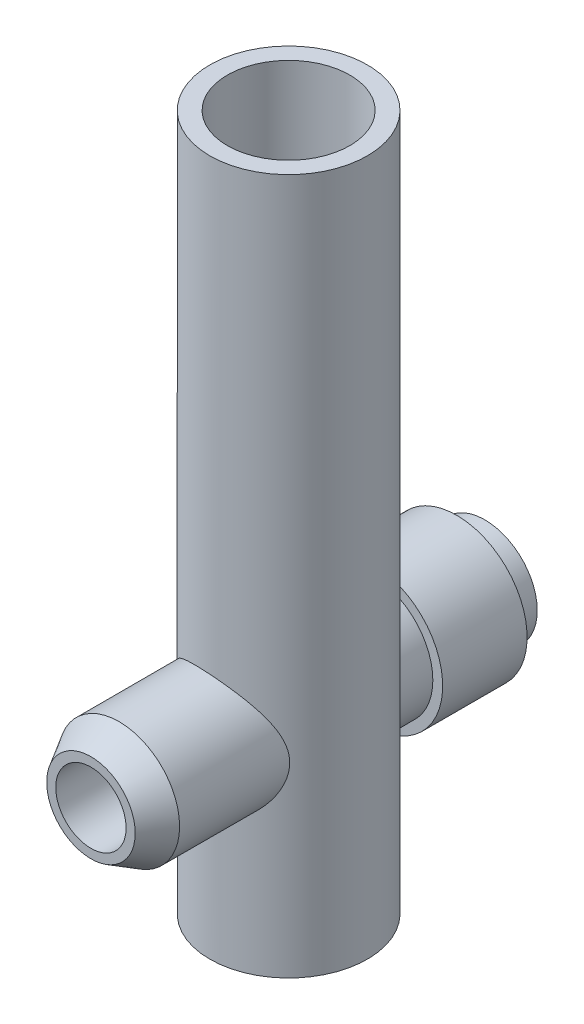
ISO-10303-21;
HEADER;
FILE_DESCRIPTION(('STEP AP214'),'2;1');
FILE_NAME('part.step','',(''),(''),'','','');
FILE_SCHEMA(('AUTOMOTIVE_DESIGN { 1 0 10303 214 1 1 1 1 }'));
ENDSEC;
DATA;
#1=APPLICATION_CONTEXT('core data for automotive mechanical design processes');
#2=APPLICATION_PROTOCOL_DEFINITION('international standard','automotive_design',2000,#1);
#3=PRODUCT_CONTEXT('',#1,'mechanical');
#4=PRODUCT('Part','Part','',(#3));
#5=PRODUCT_RELATED_PRODUCT_CATEGORY('part','',(#4));
#6=PRODUCT_DEFINITION_FORMATION('','',#4);
#7=PRODUCT_DEFINITION_CONTEXT('part definition',#1,'design');
#8=PRODUCT_DEFINITION('design','',#6,#7);
#9=PRODUCT_DEFINITION_SHAPE('','',#8);
#10=(LENGTH_UNIT() NAMED_UNIT(*) SI_UNIT(.MILLI.,.METRE.));
#11=(NAMED_UNIT(*) PLANE_ANGLE_UNIT() SI_UNIT($,.RADIAN.));
#12=(NAMED_UNIT(*) SI_UNIT($,.STERADIAN.) SOLID_ANGLE_UNIT());
#13=UNCERTAINTY_MEASURE_WITH_UNIT(LENGTH_MEASURE(1.E-05),#10,'distance_accuracy_value','');
#14=(GEOMETRIC_REPRESENTATION_CONTEXT(3) GLOBAL_UNCERTAINTY_ASSIGNED_CONTEXT((#13)) GLOBAL_UNIT_ASSIGNED_CONTEXT((#10,
#11,#12)) REPRESENTATION_CONTEXT('',''));
#15=CARTESIAN_POINT('',(0.,0.,0.));
#16=DIRECTION('',(0.,0.,1.));
#17=DIRECTION('',(1.,0.,0.));
#18=AXIS2_PLACEMENT_3D('',#15,#16,#17);
#19=CARTESIAN_POINT('',(0.,0.,0.));
#20=DIRECTION('',(0.,0.,1.));
#21=DIRECTION('',(1.,0.,0.));
#22=AXIS2_PLACEMENT_3D('',#19,#20,#21);
#23=CYLINDRICAL_SURFACE('',#22,3.175);
#24=CARTESIAN_POINT('',(3.175,0.,11.5573082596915));
#25=CARTESIAN_POINT('',(3.17499890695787,0.0853927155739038,11.5573072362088));
#26=CARTESIAN_POINT('',(3.1715482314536,0.170810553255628,11.5558295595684));
#27=CARTESIAN_POINT('',(3.15779168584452,0.341006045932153,11.5499801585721));
#28=CARTESIAN_POINT('',(3.14748190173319,0.425783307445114,11.5456067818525));
#29=CARTESIAN_POINT('',(3.10633956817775,0.678505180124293,11.5283272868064));
#30=CARTESIAN_POINT('',(3.06529432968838,0.84463178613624,11.5112623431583));
#31=CARTESIAN_POINT('',(2.95784444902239,1.1664124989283,11.4684966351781));
#32=CARTESIAN_POINT('',(2.89153438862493,1.32210314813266,11.4428281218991));
#33=CARTESIAN_POINT('',(2.73565251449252,1.62022034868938,11.3860904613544));
#34=CARTESIAN_POINT('',(2.64608444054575,1.76264902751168,11.355022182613));
#35=CARTESIAN_POINT('',(2.44074358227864,2.03823963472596,11.2894034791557));
#36=CARTESIAN_POINT('',(2.32386455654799,2.17055463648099,11.2547562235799));
#37=CARTESIAN_POINT('',(2.06946914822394,2.41432474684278,11.1875861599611));
#38=CARTESIAN_POINT('',(1.93194701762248,2.52577402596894,11.1550639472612));
#39=CARTESIAN_POINT('',(1.63523892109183,2.72757803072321,11.0952910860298));
#40=CARTESIAN_POINT('',(1.47555470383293,2.81725574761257,11.0682132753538));
#41=CARTESIAN_POINT('',(1.14196767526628,2.96816356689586,11.0243325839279));
#42=CARTESIAN_POINT('',(0.968072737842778,3.0294092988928,11.0075240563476));
#43=CARTESIAN_POINT('',(0.62258583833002,3.11814578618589,10.9876301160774));
#44=CARTESIAN_POINT('',(0.451514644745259,3.14748724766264,10.9837614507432));
#45=CARTESIAN_POINT('',(0.107083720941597,3.17789557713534,10.9886929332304));
#46=CARTESIAN_POINT('',(-0.0662752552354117,3.17897153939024,10.9974890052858));
#47=CARTESIAN_POINT('',(-0.400650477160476,3.15384459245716,11.0266960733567));
#48=CARTESIAN_POINT('',(-0.561834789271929,3.12908052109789,11.0464685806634));
#49=CARTESIAN_POINT('',(-0.877093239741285,3.05573848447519,11.095841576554));
#50=CARTESIAN_POINT('',(-1.03116635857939,3.00715711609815,11.1254434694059));
#51=CARTESIAN_POINT('',(-1.33395756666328,2.88595082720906,11.1935592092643));
#52=CARTESIAN_POINT('',(-1.48229782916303,2.81254177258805,11.2323494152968));
#53=CARTESIAN_POINT('',(-1.76475640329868,2.64448478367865,11.3153189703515));
#54=CARTESIAN_POINT('',(-1.8988685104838,2.54982763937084,11.3595006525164));
#55=CARTESIAN_POINT('',(-2.16194296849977,2.33202933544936,11.4540640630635));
#56=CARTESIAN_POINT('',(-2.28934636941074,2.20708777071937,11.5046453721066));
#57=CARTESIAN_POINT('',(-2.52191021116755,1.93710215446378,11.603682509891));
#58=CARTESIAN_POINT('',(-2.62705727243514,1.79204609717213,11.6521370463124));
#59=CARTESIAN_POINT('',(-2.81556373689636,1.47910288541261,11.7434540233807));
#60=CARTESIAN_POINT('',(-2.89801608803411,1.31058757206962,11.786056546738));
#61=CARTESIAN_POINT('',(-3.03246822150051,0.959182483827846,11.8577351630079));
#62=CARTESIAN_POINT('',(-3.08450680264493,0.776311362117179,11.8868284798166));
#63=CARTESIAN_POINT('',(-3.1516342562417,0.420937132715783,11.9247870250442));
#64=CARTESIAN_POINT('',(-3.16989207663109,0.249220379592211,11.9353810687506));
#65=CARTESIAN_POINT('',(-3.17823715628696,-0.0950929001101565,11.9401936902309));
#66=CARTESIAN_POINT('',(-3.16833801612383,-0.26768896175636,11.9344201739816));
#67=CARTESIAN_POINT('',(-3.12329903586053,-0.59141605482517,11.9087216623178));
#68=CARTESIAN_POINT('',(-3.0906632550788,-0.743021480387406,11.8902026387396));
#69=CARTESIAN_POINT('',(-3.00434564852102,-1.03837304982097,11.8427106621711));
#70=CARTESIAN_POINT('',(-2.95065773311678,-1.18211690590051,11.813734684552));
#71=CARTESIAN_POINT('',(-2.82025781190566,-1.46724493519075,11.7462660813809));
#72=CARTESIAN_POINT('',(-2.74236055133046,-1.60797348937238,11.707307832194));
#73=CARTESIAN_POINT('',(-2.56708601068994,-1.87516837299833,11.6245777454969));
#74=CARTESIAN_POINT('',(-2.46969842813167,-2.00162710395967,11.5808033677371));
#75=CARTESIAN_POINT('',(-2.24420482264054,-2.25301748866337,11.486483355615));
#76=CARTESIAN_POINT('',(-2.11378878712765,-2.37582354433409,11.4357701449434));
#77=CARTESIAN_POINT('',(-1.8334290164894,-2.59830669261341,11.3374027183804));
#78=CARTESIAN_POINT('',(-1.68347896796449,-2.69797627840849,11.2897494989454));
#79=CARTESIAN_POINT('',(-1.36269957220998,-2.87367700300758,11.2005078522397));
#80=CARTESIAN_POINT('',(-1.19140269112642,-2.94896701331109,11.1591269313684));
#81=CARTESIAN_POINT('',(-0.836071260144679,-3.06866121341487,11.0880771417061));
#82=CARTESIAN_POINT('',(-0.652046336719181,-3.11308847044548,11.058399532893));
#83=CARTESIAN_POINT('',(-0.2926915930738,-3.16625937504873,11.0153591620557));
#84=CARTESIAN_POINT('',(-0.117886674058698,-3.17763103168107,11.0008578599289));
#85=CARTESIAN_POINT('',(0.231775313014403,-3.17134757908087,10.984915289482));
#86=CARTESIAN_POINT('',(0.406632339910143,-3.15370287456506,10.9834693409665));
#87=CARTESIAN_POINT('',(0.739699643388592,-3.09197902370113,10.9927199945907));
#88=CARTESIAN_POINT('',(0.898261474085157,-3.04965191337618,11.00265041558));
#89=CARTESIAN_POINT('',(1.20621470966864,-2.94148153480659,11.0318434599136));
#90=CARTESIAN_POINT('',(1.35560502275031,-2.87563547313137,11.0511071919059));
#91=CARTESIAN_POINT('',(1.64588322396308,-2.72021936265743,11.0972958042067));
#92=CARTESIAN_POINT('',(1.78639693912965,-2.63001441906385,11.1244274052));
#93=CARTESIAN_POINT('',(2.05105553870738,-2.42927984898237,11.1830325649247));
#94=CARTESIAN_POINT('',(2.17519481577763,-2.31874329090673,11.2145076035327));
#95=CARTESIAN_POINT('',(2.41298687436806,-2.07115825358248,11.280762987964));
#96=CARTESIAN_POINT('',(2.52522172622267,-1.93276677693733,11.315617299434));
#97=CARTESIAN_POINT('',(2.72539465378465,-1.63844136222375,11.3821793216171));
#98=CARTESIAN_POINT('',(2.81331677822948,-1.48249600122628,11.4138849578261));
#99=CARTESIAN_POINT('',(2.92544249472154,-1.23721378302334,11.456116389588));
#100=CARTESIAN_POINT('',(2.95972097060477,-1.15282324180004,11.4693914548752));
#101=CARTESIAN_POINT('',(3.02098160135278,-0.981116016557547,11.4935520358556));
#102=CARTESIAN_POINT('',(3.04796709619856,-0.893800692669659,11.5044386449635));
#103=CARTESIAN_POINT('',(3.09430502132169,-0.717097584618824,11.523373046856));
#104=CARTESIAN_POINT('',(3.11367552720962,-0.627715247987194,11.5314275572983));
#105=CARTESIAN_POINT('',(3.14464356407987,-0.447432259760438,11.5444012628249));
#106=CARTESIAN_POINT('',(3.1562464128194,-0.356532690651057,11.549322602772));
#107=CARTESIAN_POINT('',(3.16759632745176,-0.221176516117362,11.5541493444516));
#108=CARTESIAN_POINT('',(3.17037154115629,-0.176997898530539,11.555332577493));
#109=CARTESIAN_POINT('',(3.17407367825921,-0.0885484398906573,11.5569123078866));
#110=CARTESIAN_POINT('',(3.17500056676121,-0.0442775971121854,11.5573087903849));
#111=CARTESIAN_POINT('',(3.175,0.,11.5573082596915));
#112=B_SPLINE_CURVE_WITH_KNOTS('',3,(#24,#25,#26,#27,#28,#29,#30,#31,#32,#33,#34,#35,#36,#37,
#38,#39,#40,#41,#42,#43,#44,#45,#46,#47,#48,#49,#50,#51,#52,#53,#54,#55,#56,#57,#58,#59,#60,#61,
#62,#63,#64,#65,#66,#67,#68,#69,#70,#71,#72,#73,#74,#75,#76,#77,#78,#79,#80,#81,#82,#83,#84,#85,
#86,#87,#88,#89,#90,#91,#92,#93,#94,#95,#96,#97,#98,#99,#100,#101,#102,#103,#104,#105,#106,#107,
#108,#109,#110,#111),.UNSPECIFIED.,.T.,.F.,(4,2,2,2,2,2,2,2,2,2,2,2,2,2,2,2,2,2,2,2,2,2,2,2,2,2,
2,2,2,2,2,2,2,2,2,2,2,2,2,2,2,2,2,4),(0.,0.256130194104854,0.512406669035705,1.02557549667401,
1.53684179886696,2.04802594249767,2.58536343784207,3.12285083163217,3.67536791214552,
4.22758090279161,4.74569747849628,5.26364735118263,5.75422062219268,6.24486400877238,
6.75273036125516,7.26081727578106,7.81479074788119,8.36909630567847,8.94310014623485,
9.51637012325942,10.0324348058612,10.5482502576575,11.0147427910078,11.4813703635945,
11.9759136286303,12.4707190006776,13.0267569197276,13.5829749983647,14.154788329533,
14.7261738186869,15.2506919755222,15.7750220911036,16.2660151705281,16.7570665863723,
17.26241465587,17.7679353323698,18.3101976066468,18.8528148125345,19.1286585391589,
19.4043757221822,19.6794344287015,19.9543046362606,20.0871100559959,20.2199179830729),.UNSPECIFIED.);
#113=CARTESIAN_POINT('',(3.175,0.,11.5573082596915));
#114=VERTEX_POINT('',#113);
#115=EDGE_CURVE('E47',#114,#114,#112,.T.);
#116=ORIENTED_EDGE('',*,*,#115,.T.);
#117=EDGE_LOOP('',(#116));
#118=FACE_BOUND('',#117,.T.);
#119=CARTESIAN_POINT('',(0.,0.,0.));
#120=DIRECTION('',(0.,0.,1.));
#121=DIRECTION('',(1.,0.,0.));
#122=AXIS2_PLACEMENT_3D('',#119,#120,#121);
#123=CIRCLE('',#122,3.175);
#124=CARTESIAN_POINT('',(3.175,0.,0.));
#125=VERTEX_POINT('',#124);
#126=EDGE_CURVE('E136',#125,#125,#123,.T.);
#127=ORIENTED_EDGE('',*,*,#126,.F.);
#128=EDGE_LOOP('',(#127));
#129=FACE_BOUND('',#128,.T.);
#130=ADVANCED_FACE('F29',(#118,#129),#23,.F.);
#131=CARTESIAN_POINT('',(0.,0.,10.16));
#132=DIRECTION('',(0.,0.,1.));
#133=DIRECTION('',(1.,0.,0.));
#134=AXIS2_PLACEMENT_3D('',#131,#132,#133);
#135=PLANE('',#134);
#136=CARTESIAN_POINT('',(0.,0.,10.16));
#137=DIRECTION('',(0.,0.,1.));
#138=DIRECTION('',(1.,0.,0.));
#139=AXIS2_PLACEMENT_3D('',#136,#137,#138);
#140=CIRCLE('',#139,6.35);
#141=CARTESIAN_POINT('',(-6.35,0.,10.16));
#142=VERTEX_POINT('',#141);
#143=EDGE_CURVE('E147',#142,#142,#140,.T.);
#144=ORIENTED_EDGE('',*,*,#143,.T.);
#145=EDGE_LOOP('',(#144));
#146=FACE_BOUND('',#145,.T.);
#147=CARTESIAN_POINT('',(0.,0.,10.16));
#148=DIRECTION('',(0.,0.,1.));
#149=DIRECTION('',(1.,0.,0.));
#150=AXIS2_PLACEMENT_3D('',#147,#148,#149);
#151=CIRCLE('',#150,5.461);
#152=CARTESIAN_POINT('',(5.461,0.,10.16));
#153=VERTEX_POINT('',#152);
#154=EDGE_CURVE('E139',#153,#153,#151,.T.);
#155=ORIENTED_EDGE('',*,*,#154,.F.);
#156=EDGE_LOOP('',(#155));
#157=FACE_BOUND('',#156,.T.);
#158=ADVANCED_FACE('F100',(#146,#157),#135,.T.);
#159=CARTESIAN_POINT('',(0.,0.,2.54));
#160=DIRECTION('',(0.,0.,-1.));
#161=DIRECTION('',(-1.,0.,0.));
#162=AXIS2_PLACEMENT_3D('',#159,#160,#161);
#163=CYLINDRICAL_SURFACE('',#162,4.7244);
#164=CARTESIAN_POINT('',(0.,0.,2.54));
#165=DIRECTION('',(0.,0.,1.));
#166=DIRECTION('',(1.,0.,0.));
#167=AXIS2_PLACEMENT_3D('',#164,#165,#166);
#168=CIRCLE('',#167,4.7244);
#169=CARTESIAN_POINT('',(4.7244,0.,2.54));
#170=VERTEX_POINT('',#169);
#171=EDGE_CURVE('E40',#170,#170,#168,.T.);
#172=ORIENTED_EDGE('',*,*,#171,.F.);
#173=EDGE_LOOP('',(#172));
#174=FACE_BOUND('',#173,.T.);
#175=CARTESIAN_POINT('',(0.,0.,0.));
#176=DIRECTION('',(0.,0.,1.));
#177=DIRECTION('',(1.,0.,0.));
#178=AXIS2_PLACEMENT_3D('',#175,#176,#177);
#179=CIRCLE('',#178,4.7244);
#180=CARTESIAN_POINT('',(4.7244,0.,0.));
#181=VERTEX_POINT('',#180);
#182=EDGE_CURVE('E44',#181,#181,#179,.T.);
#183=ORIENTED_EDGE('',*,*,#182,.T.);
#184=EDGE_LOOP('',(#183));
#185=FACE_BOUND('',#184,.T.);
#186=ADVANCED_FACE('F103',(#174,#185),#163,.T.);
#187=CARTESIAN_POINT('',(0.,0.,0.));
#188=DIRECTION('',(0.,0.,1.));
#189=DIRECTION('',(1.,0.,0.));
#190=AXIS2_PLACEMENT_3D('',#187,#188,#189);
#191=PLANE('',#190);
#192=ORIENTED_EDGE('',*,*,#126,.T.);
#193=EDGE_LOOP('',(#192));
#194=FACE_BOUND('',#193,.T.);
#195=ORIENTED_EDGE('',*,*,#182,.F.);
#196=EDGE_LOOP('',(#195));
#197=FACE_BOUND('',#196,.T.);
#198=ADVANCED_FACE('F98',(#194,#197),#191,.F.);
#199=CARTESIAN_POINT('',(0.,0.,2.54));
#200=DIRECTION('',(0.,0.,1.));
#201=DIRECTION('',(1.,0.,0.));
#202=AXIS2_PLACEMENT_3D('',#199,#200,#201);
#203=PLANE('',#202);
#204=CARTESIAN_POINT('',(0.,0.,2.54));
#205=DIRECTION('',(0.,0.,1.));
#206=DIRECTION('',(1.,0.,0.));
#207=AXIS2_PLACEMENT_3D('',#204,#205,#206);
#208=CIRCLE('',#207,6.35);
#209=CARTESIAN_POINT('',(-6.35,0.,2.54));
#210=VERTEX_POINT('',#209);
#211=EDGE_CURVE('E144',#210,#210,#208,.T.);
#212=ORIENTED_EDGE('',*,*,#211,.F.);
#213=EDGE_LOOP('',(#212));
#214=FACE_BOUND('',#213,.T.);
#215=ORIENTED_EDGE('',*,*,#171,.T.);
#216=EDGE_LOOP('',(#215));
#217=FACE_BOUND('',#216,.T.);
#218=ADVANCED_FACE('F94',(#214,#217),#203,.F.);
#219=CARTESIAN_POINT('',(0.,0.,10.16));
#220=DIRECTION('',(0.,0.,-1.));
#221=DIRECTION('',(-1.,0.,0.));
#222=AXIS2_PLACEMENT_3D('',#219,#220,#221);
#223=CYLINDRICAL_SURFACE('',#222,6.35);
#224=CARTESIAN_POINT('',(-6.35,0.,10.16));
#225=CARTESIAN_POINT('',(-6.35,0.,10.080625));
#226=CARTESIAN_POINT('',(-6.35,0.,10.00125));
#227=CARTESIAN_POINT('',(-6.35,0.,9.8425));
#228=CARTESIAN_POINT('',(-6.35,0.,9.763125));
#229=CARTESIAN_POINT('',(-6.35,0.,9.604375));
#230=CARTESIAN_POINT('',(-6.35,0.,9.525));
#231=CARTESIAN_POINT('',(-6.35,0.,9.36625));
#232=CARTESIAN_POINT('',(-6.35,0.,9.286875));
#233=CARTESIAN_POINT('',(-6.35,0.,9.128125));
#234=CARTESIAN_POINT('',(-6.35,0.,9.04875));
#235=CARTESIAN_POINT('',(-6.35,0.,8.89));
#236=CARTESIAN_POINT('',(-6.35,0.,8.810625));
#237=CARTESIAN_POINT('',(-6.35,0.,8.651875));
#238=CARTESIAN_POINT('',(-6.35,0.,8.5725));
#239=CARTESIAN_POINT('',(-6.35,0.,8.41375));
#240=CARTESIAN_POINT('',(-6.35,0.,8.334375));
#241=CARTESIAN_POINT('',(-6.35,0.,8.175625));
#242=CARTESIAN_POINT('',(-6.35,0.,8.09625));
#243=CARTESIAN_POINT('',(-6.35,0.,7.9375));
#244=CARTESIAN_POINT('',(-6.35,0.,7.858125));
#245=CARTESIAN_POINT('',(-6.35,0.,7.699375));
#246=CARTESIAN_POINT('',(-6.35,0.,7.62));
#247=CARTESIAN_POINT('',(-6.35,0.,7.46125));
#248=CARTESIAN_POINT('',(-6.35,0.,7.381875));
#249=CARTESIAN_POINT('',(-6.35,0.,7.223125));
#250=CARTESIAN_POINT('',(-6.35,0.,7.14375));
#251=CARTESIAN_POINT('',(-6.35,0.,6.985));
#252=CARTESIAN_POINT('',(-6.35,0.,6.905625));
#253=CARTESIAN_POINT('',(-6.35,0.,6.746875));
#254=CARTESIAN_POINT('',(-6.35,0.,6.6675));
#255=CARTESIAN_POINT('',(-6.35,0.,6.50875));
#256=CARTESIAN_POINT('',(-6.35,0.,6.429375));
#257=CARTESIAN_POINT('',(-6.35,0.,6.270625));
#258=CARTESIAN_POINT('',(-6.35,0.,6.19125));
#259=CARTESIAN_POINT('',(-6.35,0.,6.0325));
#260=CARTESIAN_POINT('',(-6.35,0.,5.953125));
#261=CARTESIAN_POINT('',(-6.35,0.,5.794375));
#262=CARTESIAN_POINT('',(-6.35,0.,5.715));
#263=CARTESIAN_POINT('',(-6.35,0.,5.55625));
#264=CARTESIAN_POINT('',(-6.35,0.,5.476875));
#265=CARTESIAN_POINT('',(-6.35,0.,5.318125));
#266=CARTESIAN_POINT('',(-6.35,0.,5.23875));
#267=CARTESIAN_POINT('',(-6.35,0.,5.08));
#268=CARTESIAN_POINT('',(-6.35,0.,5.000625));
#269=CARTESIAN_POINT('',(-6.35,0.,4.841875));
#270=CARTESIAN_POINT('',(-6.35,0.,4.7625));
#271=CARTESIAN_POINT('',(-6.35,0.,4.60375));
#272=CARTESIAN_POINT('',(-6.35,0.,4.524375));
#273=CARTESIAN_POINT('',(-6.35,0.,4.365625));
#274=CARTESIAN_POINT('',(-6.35,0.,4.28625));
#275=CARTESIAN_POINT('',(-6.35,0.,4.1275));
#276=CARTESIAN_POINT('',(-6.35,0.,4.048125));
#277=CARTESIAN_POINT('',(-6.35,0.,3.889375));
#278=CARTESIAN_POINT('',(-6.35,0.,3.81));
#279=CARTESIAN_POINT('',(-6.35,0.,3.65125));
#280=CARTESIAN_POINT('',(-6.35,0.,3.571875));
#281=CARTESIAN_POINT('',(-6.35,0.,3.413125));
#282=CARTESIAN_POINT('',(-6.35,0.,3.33375));
#283=CARTESIAN_POINT('',(-6.35,0.,3.175));
#284=CARTESIAN_POINT('',(-6.35,0.,3.095625));
#285=CARTESIAN_POINT('',(-6.35,0.,2.936875));
#286=CARTESIAN_POINT('',(-6.35,0.,2.8575));
#287=CARTESIAN_POINT('',(-6.35,0.,2.69875));
#288=CARTESIAN_POINT('',(-6.35,0.,2.619375));
#289=CARTESIAN_POINT('',(-6.35,0.,2.54));
#290=B_SPLINE_CURVE_WITH_KNOTS('',3,(#224,#225,#226,#227,#228,#229,#230,#231,#232,#233,#234,
#235,#236,#237,#238,#239,#240,#241,#242,#243,#244,#245,#246,#247,#248,#249,#250,#251,#252,#253,
#254,#255,#256,#257,#258,#259,#260,#261,#262,#263,#264,#265,#266,#267,#268,#269,#270,#271,#272,
#273,#274,#275,#276,#277,#278,#279,#280,#281,#282,#283,#284,#285,#286,#287,#288,#289),
.UNSPECIFIED.,.F.,.F.,(4,2,2,2,2,2,2,2,2,2,2,2,2,2,2,2,2,2,2,2,2,2,2,2,2,2,2,2,2,2,2,2,4),(0.,
0.238124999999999,0.476249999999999,0.714375,0.952499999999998,1.190625,1.42875,1.666875,1.905,
2.143125,2.38125,2.619375,2.8575,3.095625,3.33375,3.571875,3.81,4.048125,4.28625,4.524375,
4.7625,5.000625,5.23875,5.476875,5.715,5.953125,6.19125,6.429375,6.6675,6.905625,7.14375,
7.381875,7.62),.UNSPECIFIED.);
#291=EDGE_CURVE('BSEAM90',#142,#210,#290,.T.);
#292=ORIENTED_EDGE('',*,*,#143,.F.);
#293=ORIENTED_EDGE('',*,*,#211,.T.);
#294=ORIENTED_EDGE('',*,*,#291,.T.);
#295=ORIENTED_EDGE('',*,*,#291,.F.);
#296=EDGE_LOOP('',(#292,#294,#293,#295));
#297=FACE_BOUND('',#296,.T.);
#298=ADVANCED_FACE('F90',(#297),#223,.T.);
#299=CARTESIAN_POINT('',(0.,0.,35.56));
#300=DIRECTION('',(0.,0.,-1.));
#301=DIRECTION('',(-1.,0.,0.));
#302=AXIS2_PLACEMENT_3D('',#299,#300,#301);
#303=CYLINDRICAL_SURFACE('',#302,5.461);
#304=CARTESIAN_POINT('',(-5.461,0.,14.0414452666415));
#305=CARTESIAN_POINT('',(-5.4610043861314,0.0984227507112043,14.0414558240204));
#306=CARTESIAN_POINT('',(-5.45833398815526,0.196809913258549,14.0375972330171));
#307=CARTESIAN_POINT('',(-5.4477433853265,0.392732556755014,14.0224075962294));
#308=CARTESIAN_POINT('',(-5.43982231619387,0.490267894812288,14.0110753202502));
#309=CARTESIAN_POINT('',(-5.40841159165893,0.780689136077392,13.9665623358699));
#310=CARTESIAN_POINT('',(-5.37727500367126,0.971188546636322,13.922867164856));
#311=CARTESIAN_POINT('',(-5.28235886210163,1.409400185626,13.7945788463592));
#312=CARTESIAN_POINT('',(-5.21081783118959,1.65265725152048,13.7008838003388));
#313=CARTESIAN_POINT('',(-5.08234765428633,2.00193434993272,13.5437043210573));
#314=CARTESIAN_POINT('',(-5.035883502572,2.1159710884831,13.4884109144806));
#315=CARTESIAN_POINT('',(-4.93624529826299,2.33899593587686,13.3738159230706));
#316=CARTESIAN_POINT('',(-4.88307268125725,2.44798511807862,13.3145151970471));
#317=CARTESIAN_POINT('',(-4.74538803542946,2.70814561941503,13.1664828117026));
#318=CARTESIAN_POINT('',(-4.65741098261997,2.85667240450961,13.076326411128));
#319=CARTESIAN_POINT('',(-4.46857892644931,3.14386025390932,12.8937123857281));
#320=CARTESIAN_POINT('',(-4.36771847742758,3.28251710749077,12.8012538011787));
#321=CARTESIAN_POINT('',(-4.1534126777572,3.54978908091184,12.6166569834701));
#322=CARTESIAN_POINT('',(-4.03997520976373,3.67841040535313,12.5245185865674));
#323=CARTESIAN_POINT('',(-3.80057229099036,3.92526626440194,12.3427123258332));
#324=CARTESIAN_POINT('',(-3.67461104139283,4.04350425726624,12.2530436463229));
#325=CARTESIAN_POINT('',(-3.43418716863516,4.24842338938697,12.0940226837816));
#326=CARTESIAN_POINT('',(-3.32177456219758,4.33694118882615,12.0239324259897));
#327=CARTESIAN_POINT('',(-3.08871284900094,4.50589405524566,11.8878432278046));
#328=CARTESIAN_POINT('',(-2.96806550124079,4.58633083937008,11.8218434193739));
#329=CARTESIAN_POINT('',(-2.71889500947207,4.73829055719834,11.6951013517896));
#330=CARTESIAN_POINT('',(-2.59038202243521,4.80982463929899,11.6343525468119));
#331=CARTESIAN_POINT('',(-2.32573897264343,4.94321787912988,11.5191322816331));
#332=CARTESIAN_POINT('',(-2.1896103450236,5.00507885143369,11.4646596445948));
#333=CARTESIAN_POINT('',(-1.93479700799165,5.1082806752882,11.3719769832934));
#334=CARTESIAN_POINT('',(-1.81722592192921,5.15131815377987,11.3325889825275));
#335=CARTESIAN_POINT('',(-1.57783070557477,5.22961024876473,11.2594313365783));
#336=CARTESIAN_POINT('',(-1.45600744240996,5.26486644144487,11.2256605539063));
#337=CARTESIAN_POINT('',(-1.20874290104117,5.32707340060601,11.1642839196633));
#338=CARTESIAN_POINT('',(-1.08330196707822,5.35402495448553,11.1366774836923));
#339=CARTESIAN_POINT('',(-0.829638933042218,5.39914858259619,11.0881089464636));
#340=CARTESIAN_POINT('',(-0.701418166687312,5.41732477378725,11.067143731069));
#341=CARTESIAN_POINT('',(-0.442467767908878,5.44460918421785,11.0321202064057));
#342=CARTESIAN_POINT('',(-0.311729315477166,5.45367535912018,11.0180940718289));
#343=CARTESIAN_POINT('',(-0.0493595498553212,5.46235408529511,10.9973132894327));
#344=CARTESIAN_POINT('',(0.0822717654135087,5.46196661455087,10.990558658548));
#345=CARTESIAN_POINT('',(0.345325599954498,5.4516599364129,10.9843727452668));
#346=CARTESIAN_POINT('',(0.476748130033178,5.44174123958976,10.984941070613));
#347=CARTESIAN_POINT('',(0.73829845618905,5.41246282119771,10.9932757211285));
#348=CARTESIAN_POINT('',(0.868426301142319,5.39310345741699,11.0010417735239));
#349=CARTESIAN_POINT('',(1.11736509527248,5.34685932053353,11.0226988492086));
#350=CARTESIAN_POINT('',(1.236332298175,5.32059365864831,11.036124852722));
#351=CARTESIAN_POINT('',(1.47154419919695,5.26040293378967,11.0686040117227));
#352=CARTESIAN_POINT('',(1.58778796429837,5.22647528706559,11.0876590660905));
#353=CARTESIAN_POINT('',(1.93136414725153,5.11373990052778,11.152638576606));
#354=CARTESIAN_POINT('',(2.15372996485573,5.02394406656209,11.206394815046));
#355=CARTESIAN_POINT('',(2.59720871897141,4.81063840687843,11.3353692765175));
#356=CARTESIAN_POINT('',(2.8169304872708,4.68507838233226,11.4119124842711));
#357=CARTESIAN_POINT('',(3.23351849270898,4.40789424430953,11.5787517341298));
#358=CARTESIAN_POINT('',(3.43037056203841,4.25625411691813,11.6690562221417));
#359=CARTESIAN_POINT('',(3.83347460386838,3.90025837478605,11.8748719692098));
#360=CARTESIAN_POINT('',(4.03486748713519,3.69133352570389,11.9919734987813));
#361=CARTESIAN_POINT('',(4.40223179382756,3.24447499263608,12.2274251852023));
#362=CARTESIAN_POINT('',(4.56817073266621,3.00651501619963,12.3457763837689));
#363=CARTESIAN_POINT('',(4.78184783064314,2.64082694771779,12.5099923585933));
#364=CARTESIAN_POINT('',(4.84472201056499,2.52369157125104,12.5602131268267));
#365=CARTESIAN_POINT('',(4.96228055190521,2.28388419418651,12.6570774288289));
#366=CARTESIAN_POINT('',(5.01696375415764,2.16121141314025,12.7037204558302));
#367=CARTESIAN_POINT('',(5.11758335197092,1.91077078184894,12.7918619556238));
#368=CARTESIAN_POINT('',(5.16353302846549,1.78301103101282,12.833368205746));
#369=CARTESIAN_POINT('',(5.24620592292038,1.52265365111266,12.9096793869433));
#370=CARTESIAN_POINT('',(5.28293554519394,1.39005945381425,12.9444889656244));
#371=CARTESIAN_POINT('',(5.3398998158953,1.14889563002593,12.999355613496));
#372=CARTESIAN_POINT('',(5.36197819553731,1.04111549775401,13.0209755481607));
#373=CARTESIAN_POINT('',(5.39968781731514,0.823456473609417,13.0582518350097));
#374=CARTESIAN_POINT('',(5.41532238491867,0.713578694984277,13.0739112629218));
#375=CARTESIAN_POINT('',(5.43988800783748,0.492444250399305,13.098649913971));
#376=CARTESIAN_POINT('',(5.44882567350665,0.381189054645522,13.1077356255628));
#377=CARTESIAN_POINT('',(5.45985780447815,0.157985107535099,13.1189651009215));
#378=CARTESIAN_POINT('',(5.461952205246,0.0460363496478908,13.1211087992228));
#379=CARTESIAN_POINT('',(5.45925322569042,-0.177778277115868,13.1183539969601));
#380=CARTESIAN_POINT('',(5.45445465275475,-0.289644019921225,13.1134501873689));
#381=CARTESIAN_POINT('',(5.43805840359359,-0.51238050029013,13.0968174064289));
#382=CARTESIAN_POINT('',(5.42645837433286,-0.623250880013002,13.0850860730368));
#383=CARTESIAN_POINT('',(5.38171082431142,-0.953397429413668,13.0402963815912));
#384=CARTESIAN_POINT('',(5.33861746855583,-1.17009806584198,12.9976444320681));
#385=CARTESIAN_POINT('',(5.21079963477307,-1.65917092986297,12.8760608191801));
#386=CARTESIAN_POINT('',(5.11720244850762,-1.92738038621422,12.7899106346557));
#387=CARTESIAN_POINT('',(4.94944597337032,-2.31196238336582,12.646324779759));
#388=CARTESIAN_POINT('',(4.88886997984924,-2.43735310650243,12.5959942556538));
#389=CARTESIAN_POINT('',(4.7589820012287,-2.68212305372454,12.4920795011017));
#390=CARTESIAN_POINT('',(4.68967071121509,-2.801502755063,12.438495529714));
#391=CARTESIAN_POINT('',(4.46508757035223,-3.15681959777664,12.2720374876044));
#392=CARTESIAN_POINT('',(4.29622445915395,-3.38296017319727,12.1562097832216));
#393=CARTESIAN_POINT('',(3.92514165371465,-3.80725701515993,11.9276369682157));
#394=CARTESIAN_POINT('',(3.72294474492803,-4.00543222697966,11.8148898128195));
#395=CARTESIAN_POINT('',(3.29026679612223,-4.36743968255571,11.6033908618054));
#396=CARTESIAN_POINT('',(3.06037944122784,-4.53184037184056,11.5044184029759));
#397=CARTESIAN_POINT('',(2.69441075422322,-4.75215812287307,11.3710132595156));
#398=CARTESIAN_POINT('',(2.5688323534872,-4.82124388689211,11.3290371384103));
#399=CARTESIAN_POINT('',(2.31114760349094,-4.94993207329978,11.2511027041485));
#400=CARTESIAN_POINT('',(2.17904451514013,-5.0095391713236,11.2151414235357));
#401=CARTESIAN_POINT('',(1.9077708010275,-5.11903557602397,11.1498990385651));
#402=CARTESIAN_POINT('',(1.76854616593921,-5.16883003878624,11.1206827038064));
#403=CARTESIAN_POINT('',(1.48516425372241,-5.2572647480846,11.0702623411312));
#404=CARTESIAN_POINT('',(1.34100690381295,-5.29590482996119,11.0490584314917));
#405=CARTESIAN_POINT('',(1.04917040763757,-5.3613526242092,11.0154350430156));
#406=CARTESIAN_POINT('',(0.901494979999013,-5.38817229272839,11.0030066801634));
#407=CARTESIAN_POINT('',(0.603962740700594,-5.42957613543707,10.9874360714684));
#408=CARTESIAN_POINT('',(0.45410631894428,-5.44416246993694,10.9842921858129));
#409=CARTESIAN_POINT('',(0.176543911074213,-5.45963857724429,10.9872963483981));
#410=CARTESIAN_POINT('',(0.0489157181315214,-5.4622662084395,10.9921109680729));
#411=CARTESIAN_POINT('',(-0.205768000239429,-5.45860744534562,11.0085984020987));
#412=CARTESIAN_POINT('',(-0.332823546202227,-5.45232137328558,11.0202709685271));
#413=CARTESIAN_POINT('',(-0.585381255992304,-5.43101377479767,11.0503144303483));
#414=CARTESIAN_POINT('',(-0.710883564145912,-5.41599306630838,11.0686846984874));
#415=CARTESIAN_POINT('',(-0.959467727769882,-5.37752399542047,11.1118283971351));
#416=CARTESIAN_POINT('',(-1.08254950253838,-5.35407535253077,11.1366020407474));
#417=CARTESIAN_POINT('',(-1.32208465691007,-5.29993004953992,11.1913645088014));
#418=CARTESIAN_POINT('',(-1.43862705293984,-5.26945708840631,11.2211860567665));
#419=CARTESIAN_POINT('',(-1.66812003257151,-5.20136936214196,11.2860467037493));
#420=CARTESIAN_POINT('',(-1.78106958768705,-5.16375257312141,11.3210872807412));
#421=CARTESIAN_POINT('',(-2.11380852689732,-5.04084892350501,11.4333313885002));
#422=CARTESIAN_POINT('',(-2.32760138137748,-4.9454825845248,11.5176838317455));
#423=CARTESIAN_POINT('',(-2.67448621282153,-4.76399523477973,11.6733963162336));
#424=CARTESIAN_POINT('',(-2.8124774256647,-4.68375359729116,11.7410074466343));
#425=CARTESIAN_POINT('',(-3.07890210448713,-4.51307907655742,11.8820111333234));
#426=CARTESIAN_POINT('',(-3.20733531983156,-4.42264592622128,11.9554038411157));
#427=CARTESIAN_POINT('',(-3.4546248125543,-4.23231631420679,12.1067072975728));
#428=CARTESIAN_POINT('',(-3.57345996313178,-4.13239997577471,12.1846273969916));
#429=CARTESIAN_POINT('',(-3.80115339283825,-3.92397401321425,12.3434235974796));
#430=CARTESIAN_POINT('',(-3.91001271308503,-3.8154652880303,12.4242993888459));
#431=CARTESIAN_POINT('',(-4.119323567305,-3.58857743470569,12.5888140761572));
#432=CARTESIAN_POINT('',(-4.21961943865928,-3.47007183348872,12.6724763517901));
#433=CARTESIAN_POINT('',(-4.40983702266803,-3.22489382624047,12.8396999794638));
#434=CARTESIAN_POINT('',(-4.49975664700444,-3.09821978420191,12.9232613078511));
#435=CARTESIAN_POINT('',(-4.66893364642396,-2.83686255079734,13.0882438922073));
#436=CARTESIAN_POINT('',(-4.7482030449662,-2.70218864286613,13.169667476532));
#437=CARTESIAN_POINT('',(-4.89578966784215,-2.42455384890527,13.3280395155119));
#438=CARTESIAN_POINT('',(-4.96411233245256,-2.28159712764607,13.4049901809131));
#439=CARTESIAN_POINT('',(-5.1055752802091,-1.94844392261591,13.5706104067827));
#440=CARTESIAN_POINT('',(-5.17531087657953,-1.75566321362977,13.6570893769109));
#441=CARTESIAN_POINT('',(-5.29396850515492,-1.35629346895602,13.8097642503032));
#442=CARTESIAN_POINT('',(-5.34294408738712,-1.14974157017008,13.8760122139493));
#443=CARTESIAN_POINT('',(-5.40643064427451,-0.785398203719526,13.9637060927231));
#444=CARTESIAN_POINT('',(-5.42678003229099,-0.630425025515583,13.9925331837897));
#445=CARTESIAN_POINT('',(-5.45405599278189,-0.316935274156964,14.0313870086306));
#446=CARTESIAN_POINT('',(-5.46099294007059,-0.158421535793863,14.0414282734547));
#447=CARTESIAN_POINT('',(-5.461,0.,14.0414452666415));
#448=B_SPLINE_CURVE_WITH_KNOTS('',3,(#304,#305,#306,#307,#308,#309,#310,#311,#312,#313,#314,
#315,#316,#317,#318,#319,#320,#321,#322,#323,#324,#325,#326,#327,#328,#329,#330,#331,#332,#333,
#334,#335,#336,#337,#338,#339,#340,#341,#342,#343,#344,#345,#346,#347,#348,#349,#350,#351,#352,
#353,#354,#355,#356,#357,#358,#359,#360,#361,#362,#363,#364,#365,#366,#367,#368,#369,#370,#371,
#372,#373,#374,#375,#376,#377,#378,#379,#380,#381,#382,#383,#384,#385,#386,#387,#388,#389,#390,
#391,#392,#393,#394,#395,#396,#397,#398,#399,#400,#401,#402,#403,#404,#405,#406,#407,#408,#409,
#410,#411,#412,#413,#414,#415,#416,#417,#418,#419,#420,#421,#422,#423,#424,#425,#426,#427,#428,
#429,#430,#431,#432,#433,#434,#435,#436,#437,#438,#439,#440,#441,#442,#443,#444,#445,#446,#447),
.UNSPECIFIED.,.T.,.F.,(4,2,2,2,2,2,2,2,2,2,2,2,2,2,2,2,2,2,2,2,2,2,2,2,2,2,2,2,2,2,2,2,2,2,2,2,
2,2,2,2,2,2,2,2,2,2,2,2,2,2,2,2,2,2,2,2,2,2,2,2,2,2,2,2,2,2,2,2,2,2,2,4),(0.,0.295092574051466,
0.590233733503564,1.18111190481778,1.98736108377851,2.39210883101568,2.79677011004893,
3.38026534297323,3.96400803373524,4.54738690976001,5.13057074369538,5.60811878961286,
6.08556514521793,6.56240747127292,7.03916023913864,7.4325228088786,7.8258056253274,
8.21905114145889,8.61211198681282,9.00697865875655,9.40184625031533,9.79669269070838,
10.1915241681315,10.5588150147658,10.9262299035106,11.6604882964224,12.4507920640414,
13.2415828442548,14.1769227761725,15.1131160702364,15.5391528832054,15.9652499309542,
16.3906937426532,16.8158412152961,17.151879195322,17.487743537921,17.8232759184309,
18.1588114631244,18.4945999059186,18.8305045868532,19.5026424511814,20.3881325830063,
20.8320384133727,21.2759089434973,22.1877086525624,23.0988876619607,23.9931786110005,
24.4407574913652,24.8881149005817,25.3396043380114,25.7911004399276,26.2421388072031,
26.693097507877,27.0758516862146,27.4585920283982,27.8412965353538,28.2240137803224,
28.5959090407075,28.9679098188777,29.7115573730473,30.2310287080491,30.7505136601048,
31.2711125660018,31.7916570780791,32.3202341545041,32.8489174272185,33.3769987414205,
33.9048167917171,34.5705300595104,35.2345155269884,35.7098652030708,36.1848470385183),.UNSPECIFIED.);
#449=CARTESIAN_POINT('',(-5.461,0.,14.0414452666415));
#450=VERTEX_POINT('',#449);
#451=EDGE_CURVE('E54',#450,#450,#448,.T.);
#452=ORIENTED_EDGE('',*,*,#451,.T.);
#453=EDGE_LOOP('',(#452));
#454=FACE_BOUND('',#453,.T.);
#455=ORIENTED_EDGE('',*,*,#154,.T.);
#456=EDGE_LOOP('',(#455));
#457=FACE_BOUND('',#456,.T.);
#458=ADVANCED_FACE('F86',(#454,#457),#303,.T.);
#459=CARTESIAN_POINT('',(0.381000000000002,-16.8275,18.0975));
#460=DIRECTION('',(0.,1.,0.));
#461=DIRECTION('',(0.,0.,1.));
#462=AXIS2_PLACEMENT_3D('',#459,#460,#461);
#463=CYLINDRICAL_SURFACE('',#462,7.112);
#464=ORIENTED_EDGE('',*,*,#115,.F.);
#465=EDGE_LOOP('',(#464));
#466=FACE_BOUND('',#465,.T.);
#467=ADVANCED_FACE('F66',(#466),#463,.T.);
#468=ORIENTED_EDGE('',*,*,#451,.F.);
#469=EDGE_LOOP('',(#468));
#470=FACE_BOUND('',#469,.T.);
#471=CARTESIAN_POINT('',(0.381000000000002,-16.8275,18.0975));
#472=DIRECTION('',(0.,1.,0.));
#473=DIRECTION('',(0.,0.,1.));
#474=AXIS2_PLACEMENT_3D('',#471,#472,#473);
#475=CIRCLE('',#474,7.112);
#476=CARTESIAN_POINT('',(0.381000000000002,-16.8275,25.2095));
#477=VERTEX_POINT('',#476);
#478=EDGE_CURVE('E81',#477,#477,#475,.T.);
#479=ORIENTED_EDGE('',*,*,#478,.T.);
#480=EDGE_LOOP('',(#479));
#481=FACE_BOUND('',#480,.T.);
#482=CARTESIAN_POINT('',(0.381000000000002,45.974,18.0975));
#483=DIRECTION('',(0.,1.,0.));
#484=DIRECTION('',(0.,0.,1.));
#485=AXIS2_PLACEMENT_3D('',#482,#483,#484);
#486=CIRCLE('',#485,7.112);
#487=CARTESIAN_POINT('',(0.381000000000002,45.974,25.2095));
#488=VERTEX_POINT('',#487);
#489=EDGE_CURVE('E189',#488,#488,#486,.T.);
#490=ORIENTED_EDGE('',*,*,#489,.F.);
#491=EDGE_LOOP('',(#490));
#492=FACE_BOUND('',#491,.T.);
#493=CARTESIAN_POINT('',(-5.461,0.,22.1535547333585));
#494=CARTESIAN_POINT('',(-5.4610043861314,-0.0984227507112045,22.1535441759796));
#495=CARTESIAN_POINT('',(-5.45833398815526,-0.196809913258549,22.1574027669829));
#496=CARTESIAN_POINT('',(-5.4477433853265,-0.392732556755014,22.1725924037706));
#497=CARTESIAN_POINT('',(-5.43982231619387,-0.490267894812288,22.1839246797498));
#498=CARTESIAN_POINT('',(-5.40841159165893,-0.780689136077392,22.2284376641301));
#499=CARTESIAN_POINT('',(-5.37727500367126,-0.971188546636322,22.272132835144));
#500=CARTESIAN_POINT('',(-5.28235886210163,-1.409400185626,22.4004211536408));
#501=CARTESIAN_POINT('',(-5.21081783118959,-1.65265725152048,22.4941161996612));
#502=CARTESIAN_POINT('',(-5.08234765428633,-2.00193434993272,22.6512956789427));
#503=CARTESIAN_POINT('',(-5.035883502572,-2.1159710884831,22.7065890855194));
#504=CARTESIAN_POINT('',(-4.93624529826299,-2.33899593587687,22.8211840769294));
#505=CARTESIAN_POINT('',(-4.88307268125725,-2.44798511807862,22.8804848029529));
#506=CARTESIAN_POINT('',(-4.74538803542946,-2.70814561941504,23.0285171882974));
#507=CARTESIAN_POINT('',(-4.65741098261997,-2.85667240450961,23.118673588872));
#508=CARTESIAN_POINT('',(-4.46857892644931,-3.14386025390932,23.3012876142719));
#509=CARTESIAN_POINT('',(-4.36771847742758,-3.28251710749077,23.3937461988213));
#510=CARTESIAN_POINT('',(-4.15341267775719,-3.54978908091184,23.5783430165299));
#511=CARTESIAN_POINT('',(-4.03997520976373,-3.67841040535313,23.6704814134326));
#512=CARTESIAN_POINT('',(-3.80057229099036,-3.92526626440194,23.8522876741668));
#513=CARTESIAN_POINT('',(-3.67461104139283,-4.04350425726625,23.9419563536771));
#514=CARTESIAN_POINT('',(-3.43418716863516,-4.24842338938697,24.1009773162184));
#515=CARTESIAN_POINT('',(-3.32177456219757,-4.33694118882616,24.1710675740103));
#516=CARTESIAN_POINT('',(-3.08871284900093,-4.50589405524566,24.3071567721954));
#517=CARTESIAN_POINT('',(-2.96806550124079,-4.58633083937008,24.3731565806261));
#518=CARTESIAN_POINT('',(-2.71889500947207,-4.73829055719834,24.4998986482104));
#519=CARTESIAN_POINT('',(-2.5903820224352,-4.80982463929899,24.5606474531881));
#520=CARTESIAN_POINT('',(-2.32573897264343,-4.94321787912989,24.6758677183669));
#521=CARTESIAN_POINT('',(-2.18961034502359,-5.00507885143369,24.7303403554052));
#522=CARTESIAN_POINT('',(-1.93479700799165,-5.1082806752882,24.8230230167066));
#523=CARTESIAN_POINT('',(-1.8172259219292,-5.15131815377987,24.8624110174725));
#524=CARTESIAN_POINT('',(-1.57783070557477,-5.22961024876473,24.9355686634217));
#525=CARTESIAN_POINT('',(-1.45600744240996,-5.26486644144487,24.9693394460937));
#526=CARTESIAN_POINT('',(-1.20874290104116,-5.32707340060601,25.0307160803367));
#527=CARTESIAN_POINT('',(-1.08330196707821,-5.35402495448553,25.0583225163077));
#528=CARTESIAN_POINT('',(-0.829638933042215,-5.39914858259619,25.1068910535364));
#529=CARTESIAN_POINT('',(-0.70141816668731,-5.41732477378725,25.127856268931));
#530=CARTESIAN_POINT('',(-0.442467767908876,-5.44460918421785,25.1628797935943));
#531=CARTESIAN_POINT('',(-0.311729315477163,-5.45367535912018,25.1769059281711));
#532=CARTESIAN_POINT('',(-0.0493595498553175,-5.46235408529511,25.1976867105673));
#533=CARTESIAN_POINT('',(0.0822717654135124,-5.46196661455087,25.204441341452));
#534=CARTESIAN_POINT('',(0.345325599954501,-5.4516599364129,25.2106272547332));
#535=CARTESIAN_POINT('',(0.47674813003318,-5.44174123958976,25.210058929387));
#536=CARTESIAN_POINT('',(0.738298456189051,-5.41246282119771,25.2017242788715));
#537=CARTESIAN_POINT('',(0.868426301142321,-5.39310345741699,25.1939582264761));
#538=CARTESIAN_POINT('',(1.11736509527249,-5.34685932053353,25.1723011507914));
#539=CARTESIAN_POINT('',(1.236332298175,-5.32059365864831,25.158875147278));
#540=CARTESIAN_POINT('',(1.47154419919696,-5.26040293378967,25.1263959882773));
#541=CARTESIAN_POINT('',(1.58778796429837,-5.22647528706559,25.1073409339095));
#542=CARTESIAN_POINT('',(1.93136414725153,-5.11373990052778,25.042361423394));
#543=CARTESIAN_POINT('',(2.15372996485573,-5.02394406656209,24.988605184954));
#544=CARTESIAN_POINT('',(2.59720871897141,-4.81063840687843,24.8596307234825));
#545=CARTESIAN_POINT('',(2.8169304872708,-4.68507838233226,24.7830875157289));
#546=CARTESIAN_POINT('',(3.23351849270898,-4.40789424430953,24.6162482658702));
#547=CARTESIAN_POINT('',(3.43037056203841,-4.25625411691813,24.5259437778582));
#548=CARTESIAN_POINT('',(3.83347460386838,-3.90025837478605,24.3201280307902));
#549=CARTESIAN_POINT('',(4.0348674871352,-3.69133352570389,24.2030265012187));
#550=CARTESIAN_POINT('',(4.40223179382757,-3.24447499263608,23.9675748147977));
#551=CARTESIAN_POINT('',(4.56817073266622,-3.00651501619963,23.8492236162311));
#552=CARTESIAN_POINT('',(4.78184783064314,-2.64082694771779,23.6850076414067));
#553=CARTESIAN_POINT('',(4.84472201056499,-2.52369157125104,23.6347868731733));
#554=CARTESIAN_POINT('',(4.96228055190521,-2.28388419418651,23.5379225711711));
#555=CARTESIAN_POINT('',(5.01696375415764,-2.16121141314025,23.4912795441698));
#556=CARTESIAN_POINT('',(5.11758335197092,-1.91077078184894,23.4031380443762));
#557=CARTESIAN_POINT('',(5.16353302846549,-1.78301103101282,23.361631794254));
#558=CARTESIAN_POINT('',(5.24620592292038,-1.52265365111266,23.2853206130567));
#559=CARTESIAN_POINT('',(5.28293554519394,-1.39005945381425,23.2505110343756));
#560=CARTESIAN_POINT('',(5.3398998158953,-1.14889563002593,23.195644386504));
#561=CARTESIAN_POINT('',(5.36197819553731,-1.04111549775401,23.1740244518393));
#562=CARTESIAN_POINT('',(5.39968781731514,-0.823456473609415,23.1367481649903));
#563=CARTESIAN_POINT('',(5.41532238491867,-0.713578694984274,23.1210887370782));
#564=CARTESIAN_POINT('',(5.43988800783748,-0.492444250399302,23.096350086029));
#565=CARTESIAN_POINT('',(5.44882567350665,-0.381189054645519,23.0872643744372));
#566=CARTESIAN_POINT('',(5.45985780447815,-0.157985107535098,23.0760348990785));
#567=CARTESIAN_POINT('',(5.461952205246,-0.0460363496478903,23.0738912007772));
#568=CARTESIAN_POINT('',(5.45925322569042,0.177778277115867,23.0766460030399));
#569=CARTESIAN_POINT('',(5.45445465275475,0.289644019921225,23.0815498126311));
#570=CARTESIAN_POINT('',(5.43805840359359,0.512380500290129,23.0981825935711));
#571=CARTESIAN_POINT('',(5.42645837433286,0.623250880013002,23.1099139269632));
#572=CARTESIAN_POINT('',(5.38171082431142,0.953397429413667,23.1547036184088));
#573=CARTESIAN_POINT('',(5.33861746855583,1.17009806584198,23.1973555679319));
#574=CARTESIAN_POINT('',(5.21079963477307,1.65917092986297,23.3189391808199));
#575=CARTESIAN_POINT('',(5.11720244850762,1.92738038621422,23.4050893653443));
#576=CARTESIAN_POINT('',(4.94944597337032,2.31196238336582,23.548675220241));
#577=CARTESIAN_POINT('',(4.88886997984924,2.43735310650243,23.5990057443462));
#578=CARTESIAN_POINT('',(4.7589820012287,2.68212305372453,23.7029204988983));
#579=CARTESIAN_POINT('',(4.68967071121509,2.801502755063,23.756504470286));
#580=CARTESIAN_POINT('',(4.46508757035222,3.15681959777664,23.9229625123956));
#581=CARTESIAN_POINT('',(4.29622445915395,3.38296017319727,24.0387902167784));
#582=CARTESIAN_POINT('',(3.92514165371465,3.80725701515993,24.2673630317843));
#583=CARTESIAN_POINT('',(3.72294474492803,4.00543222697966,24.3801101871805));
#584=CARTESIAN_POINT('',(3.29026679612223,4.36743968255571,24.5916091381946));
#585=CARTESIAN_POINT('',(3.06037944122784,4.53184037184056,24.6905815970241));
#586=CARTESIAN_POINT('',(2.69441075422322,4.75215812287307,24.8239867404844));
#587=CARTESIAN_POINT('',(2.5688323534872,4.82124388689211,24.8659628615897));
#588=CARTESIAN_POINT('',(2.31114760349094,4.94993207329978,24.9438972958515));
#589=CARTESIAN_POINT('',(2.17904451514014,5.0095391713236,24.9798585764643));
#590=CARTESIAN_POINT('',(1.9077708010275,5.11903557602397,25.0451009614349));
#591=CARTESIAN_POINT('',(1.76854616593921,5.16883003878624,25.0743172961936));
#592=CARTESIAN_POINT('',(1.48516425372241,5.2572647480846,25.1247376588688));
#593=CARTESIAN_POINT('',(1.34100690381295,5.29590482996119,25.1459415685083));
#594=CARTESIAN_POINT('',(1.04917040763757,5.3613526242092,25.1795649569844));
#595=CARTESIAN_POINT('',(0.901494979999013,5.38817229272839,25.1919933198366));
#596=CARTESIAN_POINT('',(0.603962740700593,5.42957613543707,25.2075639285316));
#597=CARTESIAN_POINT('',(0.45410631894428,5.44416246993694,25.2107078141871));
#598=CARTESIAN_POINT('',(0.176543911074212,5.45963857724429,25.2077036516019));
#599=CARTESIAN_POINT('',(0.0489157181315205,5.4622662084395,25.2028890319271));
#600=CARTESIAN_POINT('',(-0.205768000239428,5.45860744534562,25.1864015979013));
#601=CARTESIAN_POINT('',(-0.332823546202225,5.45232137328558,25.1747290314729));
#602=CARTESIAN_POINT('',(-0.585381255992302,5.43101377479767,25.1446855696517));
#603=CARTESIAN_POINT('',(-0.710883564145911,5.41599306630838,25.1263153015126));
#604=CARTESIAN_POINT('',(-0.959467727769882,5.37752399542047,25.0831716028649));
#605=CARTESIAN_POINT('',(-1.08254950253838,5.35407535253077,25.0583979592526));
#606=CARTESIAN_POINT('',(-1.32208465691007,5.29993004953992,25.0036354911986));
#607=CARTESIAN_POINT('',(-1.43862705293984,5.26945708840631,24.9738139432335));
#608=CARTESIAN_POINT('',(-1.66812003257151,5.20136936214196,24.9089532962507));
#609=CARTESIAN_POINT('',(-1.78106958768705,5.16375257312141,24.8739127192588));
#610=CARTESIAN_POINT('',(-2.11380852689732,5.04084892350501,24.7616686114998));
#611=CARTESIAN_POINT('',(-2.32760138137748,4.9454825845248,24.6773161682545));
#612=CARTESIAN_POINT('',(-2.67448621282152,4.76399523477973,24.5216036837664));
#613=CARTESIAN_POINT('',(-2.8124774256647,4.68375359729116,24.4539925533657));
#614=CARTESIAN_POINT('',(-3.07890210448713,4.51307907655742,24.3129888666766));
#615=CARTESIAN_POINT('',(-3.20733531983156,4.42264592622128,24.2395961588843));
#616=CARTESIAN_POINT('',(-3.4546248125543,4.23231631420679,24.0882927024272));
#617=CARTESIAN_POINT('',(-3.57345996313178,4.13239997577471,24.0103726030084));
#618=CARTESIAN_POINT('',(-3.80115339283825,3.92397401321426,23.8515764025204));
#619=CARTESIAN_POINT('',(-3.91001271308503,3.8154652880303,23.7707006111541));
#620=CARTESIAN_POINT('',(-4.119323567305,3.5885774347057,23.6061859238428));
#621=CARTESIAN_POINT('',(-4.21961943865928,3.47007183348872,23.5225236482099));
#622=CARTESIAN_POINT('',(-4.40983702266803,3.22489382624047,23.3553000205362));
#623=CARTESIAN_POINT('',(-4.49975664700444,3.09821978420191,23.2717386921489));
#624=CARTESIAN_POINT('',(-4.66893364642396,2.83686255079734,23.1067561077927));
#625=CARTESIAN_POINT('',(-4.7482030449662,2.70218864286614,23.025332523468));
#626=CARTESIAN_POINT('',(-4.89578966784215,2.42455384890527,22.8669604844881));
#627=CARTESIAN_POINT('',(-4.96411233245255,2.28159712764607,22.7900098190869));
#628=CARTESIAN_POINT('',(-5.1055752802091,1.94844392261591,22.6243895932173));
#629=CARTESIAN_POINT('',(-5.17531087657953,1.75566321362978,22.5379106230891));
#630=CARTESIAN_POINT('',(-5.29396850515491,1.35629346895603,22.3852357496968));
#631=CARTESIAN_POINT('',(-5.34294408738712,1.14974157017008,22.3189877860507));
#632=CARTESIAN_POINT('',(-5.40643064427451,0.785398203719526,22.2312939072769));
#633=CARTESIAN_POINT('',(-5.42678003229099,0.630425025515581,22.2024668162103));
#634=CARTESIAN_POINT('',(-5.45405599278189,0.316935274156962,22.1636129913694));
#635=CARTESIAN_POINT('',(-5.46099294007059,0.158421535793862,22.1535717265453));
#636=CARTESIAN_POINT('',(-5.461,0.,22.1535547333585));
#637=B_SPLINE_CURVE_WITH_KNOTS('',3,(#493,#494,#495,#496,#497,#498,#499,#500,#501,#502,#503,
#504,#505,#506,#507,#508,#509,#510,#511,#512,#513,#514,#515,#516,#517,#518,#519,#520,#521,#522,
#523,#524,#525,#526,#527,#528,#529,#530,#531,#532,#533,#534,#535,#536,#537,#538,#539,#540,#541,
#542,#543,#544,#545,#546,#547,#548,#549,#550,#551,#552,#553,#554,#555,#556,#557,#558,#559,#560,
#561,#562,#563,#564,#565,#566,#567,#568,#569,#570,#571,#572,#573,#574,#575,#576,#577,#578,#579,
#580,#581,#582,#583,#584,#585,#586,#587,#588,#589,#590,#591,#592,#593,#594,#595,#596,#597,#598,
#599,#600,#601,#602,#603,#604,#605,#606,#607,#608,#609,#610,#611,#612,#613,#614,#615,#616,#617,
#618,#619,#620,#621,#622,#623,#624,#625,#626,#627,#628,#629,#630,#631,#632,#633,#634,#635,#636),
.UNSPECIFIED.,.T.,.F.,(4,2,2,2,2,2,2,2,2,2,2,2,2,2,2,2,2,2,2,2,2,2,2,2,2,2,2,2,2,2,2,2,2,2,2,2,
2,2,2,2,2,2,2,2,2,2,2,2,2,2,2,2,2,2,2,2,2,2,2,2,2,2,2,2,2,2,2,2,2,2,2,4),(0.,0.295092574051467,
0.590233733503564,1.18111190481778,1.98736108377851,2.39210883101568,2.79677011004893,
3.38026534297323,3.96400803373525,4.54738690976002,5.13057074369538,5.60811878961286,
6.08556514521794,6.56240747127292,7.03916023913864,7.4325228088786,7.8258056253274,
8.21905114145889,8.61211198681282,9.00697865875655,9.40184625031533,9.79669269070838,
10.1915241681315,10.5588150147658,10.9262299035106,11.6604882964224,12.4507920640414,
13.2415828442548,14.1769227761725,15.1131160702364,15.5391528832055,15.9652499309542,
16.3906937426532,16.8158412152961,17.151879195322,17.487743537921,17.8232759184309,
18.1588114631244,18.4945999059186,18.8305045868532,19.5026424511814,20.3881325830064,
20.8320384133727,21.2759089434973,22.1877086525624,23.0988876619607,23.9931786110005,
24.4407574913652,24.8881149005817,25.3396043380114,25.7911004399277,26.2421388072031,
26.6930975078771,27.0758516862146,27.4585920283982,27.8412965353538,28.2240137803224,
28.5959090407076,28.9679098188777,29.7115573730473,30.2310287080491,30.7505136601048,
31.2711125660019,31.7916570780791,32.3202341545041,32.8489174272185,33.3769987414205,
33.9048167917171,34.5705300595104,35.2345155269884,35.7098652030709,36.1848470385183),.UNSPECIFIED.);
#638=CARTESIAN_POINT('',(-5.461,0.,22.1535547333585));
#639=VERTEX_POINT('',#638);
#640=EDGE_CURVE('E80',#639,#639,#637,.T.);
#641=ORIENTED_EDGE('',*,*,#640,.F.);
#642=EDGE_LOOP('',(#641));
#643=FACE_BOUND('',#642,.T.);
#644=ADVANCED_FACE('F61',(#470,#481,#492,#643),#463,.T.);
#645=CARTESIAN_POINT('',(0.381000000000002,-16.8275,18.0975));
#646=DIRECTION('',(0.,1.,0.));
#647=DIRECTION('',(0.,0.,1.));
#648=AXIS2_PLACEMENT_3D('',#645,#646,#647);
#649=PLANE('',#648);
#650=ORIENTED_EDGE('',*,*,#478,.F.);
#651=EDGE_LOOP('',(#650));
#652=FACE_BOUND('',#651,.T.);
#653=ADVANCED_FACE('F65',(#652),#649,.F.);
#654=CARTESIAN_POINT('',(0.381000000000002,45.974,18.0975));
#655=DIRECTION('',(0.,1.,0.));
#656=DIRECTION('',(0.,0.,1.));
#657=AXIS2_PLACEMENT_3D('',#654,#655,#656);
#658=PLANE('',#657);
#659=CARTESIAN_POINT('',(0.381000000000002,45.974,18.0975));
#660=DIRECTION('',(0.,1.,0.));
#661=DIRECTION('',(0.,0.,1.));
#662=AXIS2_PLACEMENT_3D('',#659,#660,#661);
#663=CIRCLE('',#662,5.5245);
#664=CARTESIAN_POINT('',(0.381000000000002,45.974,23.622));
#665=VERTEX_POINT('',#664);
#666=EDGE_CURVE('E190',#665,#665,#663,.T.);
#667=ORIENTED_EDGE('',*,*,#666,.F.);
#668=EDGE_LOOP('',(#667));
#669=FACE_BOUND('',#668,.T.);
#670=ORIENTED_EDGE('',*,*,#489,.T.);
#671=EDGE_LOOP('',(#670));
#672=FACE_BOUND('',#671,.T.);
#673=ADVANCED_FACE('F164',(#669,#672),#658,.T.);
#674=CARTESIAN_POINT('',(0.,0.,33.02));
#675=DIRECTION('',(0.,0.,1.));
#676=DIRECTION('',(1.,0.,0.));
#677=AXIS2_PLACEMENT_3D('',#674,#675,#676);
#678=CIRCLE('',#677,5.461);
#679=CARTESIAN_POINT('',(5.461,0.,33.02));
#680=VERTEX_POINT('',#679);
#681=EDGE_CURVE('E10',#680,#680,#678,.F.);
#682=ORIENTED_EDGE('',*,*,#681,.T.);
#683=EDGE_LOOP('',(#682));
#684=FACE_BOUND('',#683,.T.);
#685=ORIENTED_EDGE('',*,*,#640,.T.);
#686=EDGE_LOOP('',(#685));
#687=FACE_BOUND('',#686,.T.);
#688=ADVANCED_FACE('F92',(#684,#687),#303,.T.);
#689=CARTESIAN_POINT('',(0.,0.,35.56));
#690=DIRECTION('',(0.,0.,1.));
#691=DIRECTION('',(1.,0.,0.));
#692=AXIS2_PLACEMENT_3D('',#689,#690,#691);
#693=PLANE('',#692);
#694=CARTESIAN_POINT('',(0.,0.,35.56));
#695=DIRECTION('',(0.,0.,1.));
#696=DIRECTION('',(1.,0.,0.));
#697=AXIS2_PLACEMENT_3D('',#694,#695,#696);
#698=CIRCLE('',#697,3.99453031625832);
#699=CARTESIAN_POINT('',(3.99453031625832,0.,35.56));
#700=VERTEX_POINT('',#699);
#701=EDGE_CURVE('E36',#700,#700,#698,.T.);
#702=ORIENTED_EDGE('',*,*,#701,.T.);
#703=EDGE_LOOP('',(#702));
#704=FACE_BOUND('',#703,.T.);
#705=CARTESIAN_POINT('',(0.,0.,35.56));
#706=DIRECTION('',(0.,0.,1.));
#707=DIRECTION('',(1.,0.,0.));
#708=AXIS2_PLACEMENT_3D('',#705,#706,#707);
#709=CIRCLE('',#708,3.175);
#710=CARTESIAN_POINT('',(3.175,0.,35.56));
#711=VERTEX_POINT('',#710);
#712=EDGE_CURVE('E134',#711,#711,#709,.T.);
#713=ORIENTED_EDGE('',*,*,#712,.F.);
#714=EDGE_LOOP('',(#713));
#715=FACE_BOUND('',#714,.T.);
#716=ADVANCED_FACE('F93',(#704,#715),#693,.T.);
#717=CARTESIAN_POINT('',(3.175,0.,24.6376917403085));
#718=CARTESIAN_POINT('',(3.17499890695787,-0.0853927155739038,24.6376927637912));
#719=CARTESIAN_POINT('',(3.1715482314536,-0.170810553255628,24.6391704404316));
#720=CARTESIAN_POINT('',(3.15779168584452,-0.341006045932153,24.6450198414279));
#721=CARTESIAN_POINT('',(3.14748190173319,-0.425783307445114,24.6493932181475));
#722=CARTESIAN_POINT('',(3.10633956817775,-0.678505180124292,24.6666727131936));
#723=CARTESIAN_POINT('',(3.06529432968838,-0.84463178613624,24.6837376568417));
#724=CARTESIAN_POINT('',(2.95784444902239,-1.16641249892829,24.7265033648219));
#725=CARTESIAN_POINT('',(2.89153438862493,-1.32210314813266,24.7521718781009));
#726=CARTESIAN_POINT('',(2.73565251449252,-1.62022034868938,24.8089095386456));
#727=CARTESIAN_POINT('',(2.64608444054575,-1.76264902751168,24.839977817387));
#728=CARTESIAN_POINT('',(2.44074358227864,-2.03823963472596,24.9055965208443));
#729=CARTESIAN_POINT('',(2.32386455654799,-2.17055463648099,24.9402437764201));
#730=CARTESIAN_POINT('',(2.06946914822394,-2.41432474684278,25.0074138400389));
#731=CARTESIAN_POINT('',(1.93194701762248,-2.52577402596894,25.0399360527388));
#732=CARTESIAN_POINT('',(1.63523892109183,-2.72757803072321,25.0997089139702));
#733=CARTESIAN_POINT('',(1.47555470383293,-2.81725574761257,25.1267867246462));
#734=CARTESIAN_POINT('',(1.14196767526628,-2.96816356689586,25.1706674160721));
#735=CARTESIAN_POINT('',(0.968072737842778,-3.0294092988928,25.1874759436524));
#736=CARTESIAN_POINT('',(0.622585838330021,-3.11814578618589,25.2073698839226));
#737=CARTESIAN_POINT('',(0.451514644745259,-3.14748724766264,25.2112385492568));
#738=CARTESIAN_POINT('',(0.107083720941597,-3.17789557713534,25.2063070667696));
#739=CARTESIAN_POINT('',(-0.0662752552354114,-3.17897153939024,25.1975109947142));
#740=CARTESIAN_POINT('',(-0.400650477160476,-3.15384459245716,25.1683039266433));
#741=CARTESIAN_POINT('',(-0.561834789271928,-3.12908052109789,25.1485314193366));
#742=CARTESIAN_POINT('',(-0.877093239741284,-3.05573848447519,25.099158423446));
#743=CARTESIAN_POINT('',(-1.03116635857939,-3.00715711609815,25.0695565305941));
#744=CARTESIAN_POINT('',(-1.33395756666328,-2.88595082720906,25.0014407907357));
#745=CARTESIAN_POINT('',(-1.48229782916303,-2.81254177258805,24.9626505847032));
#746=CARTESIAN_POINT('',(-1.76475640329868,-2.64448478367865,24.8796810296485));
#747=CARTESIAN_POINT('',(-1.8988685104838,-2.54982763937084,24.8354993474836));
#748=CARTESIAN_POINT('',(-2.16194296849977,-2.33202933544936,24.7409359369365));
#749=CARTESIAN_POINT('',(-2.28934636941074,-2.20708777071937,24.6903546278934));
#750=CARTESIAN_POINT('',(-2.52191021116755,-1.93710215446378,24.5913174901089));
#751=CARTESIAN_POINT('',(-2.62705727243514,-1.79204609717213,24.5428629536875));
#752=CARTESIAN_POINT('',(-2.81556373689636,-1.47910288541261,24.4515459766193));
#753=CARTESIAN_POINT('',(-2.89801608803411,-1.31058757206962,24.408943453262));
#754=CARTESIAN_POINT('',(-3.03246822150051,-0.959182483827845,24.3372648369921));
#755=CARTESIAN_POINT('',(-3.08450680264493,-0.776311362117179,24.3081715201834));
#756=CARTESIAN_POINT('',(-3.1516342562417,-0.420937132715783,24.2702129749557));
#757=CARTESIAN_POINT('',(-3.16989207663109,-0.249220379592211,24.2596189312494));
#758=CARTESIAN_POINT('',(-3.17823715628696,0.0950929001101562,24.2548063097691));
#759=CARTESIAN_POINT('',(-3.16833801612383,0.267688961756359,24.2605798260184));
#760=CARTESIAN_POINT('',(-3.12329903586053,0.591416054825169,24.2862783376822));
#761=CARTESIAN_POINT('',(-3.0906632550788,0.743021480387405,24.3047973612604));
#762=CARTESIAN_POINT('',(-3.00434564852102,1.03837304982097,24.3522893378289));
#763=CARTESIAN_POINT('',(-2.95065773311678,1.18211690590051,24.381265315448));
#764=CARTESIAN_POINT('',(-2.82025781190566,1.46724493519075,24.4487339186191));
#765=CARTESIAN_POINT('',(-2.74236055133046,1.60797348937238,24.487692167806));
#766=CARTESIAN_POINT('',(-2.56708601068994,1.87516837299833,24.5704222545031));
#767=CARTESIAN_POINT('',(-2.46969842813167,2.00162710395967,24.6141966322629));
#768=CARTESIAN_POINT('',(-2.24420482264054,2.25301748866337,24.708516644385));
#769=CARTESIAN_POINT('',(-2.11378878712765,2.37582354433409,24.7592298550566));
#770=CARTESIAN_POINT('',(-1.8334290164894,2.59830669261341,24.8575972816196));
#771=CARTESIAN_POINT('',(-1.68347896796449,2.69797627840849,24.9052505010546));
#772=CARTESIAN_POINT('',(-1.36269957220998,2.87367700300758,24.9944921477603));
#773=CARTESIAN_POINT('',(-1.19140269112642,2.94896701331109,25.0358730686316));
#774=CARTESIAN_POINT('',(-0.836071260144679,3.06866121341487,25.1069228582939));
#775=CARTESIAN_POINT('',(-0.652046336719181,3.11308847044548,25.136600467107));
#776=CARTESIAN_POINT('',(-0.2926915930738,3.16625937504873,25.1796408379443));
#777=CARTESIAN_POINT('',(-0.117886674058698,3.17763103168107,25.1941421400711));
#778=CARTESIAN_POINT('',(0.231775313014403,3.17134757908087,25.210084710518));
#779=CARTESIAN_POINT('',(0.406632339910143,3.15370287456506,25.2115306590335));
#780=CARTESIAN_POINT('',(0.739699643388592,3.09197902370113,25.2022800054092));
#781=CARTESIAN_POINT('',(0.898261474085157,3.04965191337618,25.19234958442));
#782=CARTESIAN_POINT('',(1.20621470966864,2.94148153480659,25.1631565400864));
#783=CARTESIAN_POINT('',(1.35560502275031,2.87563547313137,25.1438928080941));
#784=CARTESIAN_POINT('',(1.64588322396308,2.72021936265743,25.0977041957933));
#785=CARTESIAN_POINT('',(1.78639693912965,2.63001441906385,25.0705725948));
#786=CARTESIAN_POINT('',(2.05105553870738,2.42927984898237,25.0119674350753));
#787=CARTESIAN_POINT('',(2.17519481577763,2.31874329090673,24.9804923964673));
#788=CARTESIAN_POINT('',(2.41298687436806,2.07115825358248,24.914237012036));
#789=CARTESIAN_POINT('',(2.52522172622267,1.93276677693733,24.879382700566));
#790=CARTESIAN_POINT('',(2.72539465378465,1.63844136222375,24.8128206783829));
#791=CARTESIAN_POINT('',(2.81331677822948,1.48249600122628,24.7811150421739));
#792=CARTESIAN_POINT('',(2.92544249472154,1.23721378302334,24.738883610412));
#793=CARTESIAN_POINT('',(2.95972097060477,1.15282324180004,24.7256085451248));
#794=CARTESIAN_POINT('',(3.02098160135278,0.981116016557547,24.7014479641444));
#795=CARTESIAN_POINT('',(3.04796709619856,0.893800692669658,24.6905613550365));
#796=CARTESIAN_POINT('',(3.09430502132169,0.717097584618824,24.671626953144));
#797=CARTESIAN_POINT('',(3.11367552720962,0.627715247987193,24.6635724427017));
#798=CARTESIAN_POINT('',(3.14464356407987,0.447432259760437,24.6505987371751));
#799=CARTESIAN_POINT('',(3.1562464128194,0.356532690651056,24.645677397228));
#800=CARTESIAN_POINT('',(3.16759632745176,0.221176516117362,24.6408506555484));
#801=CARTESIAN_POINT('',(3.17037154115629,0.176997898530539,24.6396674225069));
#802=CARTESIAN_POINT('',(3.17407367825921,0.0885484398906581,24.6380876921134));
#803=CARTESIAN_POINT('',(3.17500056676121,0.0442775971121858,24.6376912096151));
#804=CARTESIAN_POINT('',(3.175,0.,24.6376917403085));
#805=B_SPLINE_CURVE_WITH_KNOTS('',3,(#717,#718,#719,#720,#721,#722,#723,#724,#725,#726,#727,
#728,#729,#730,#731,#732,#733,#734,#735,#736,#737,#738,#739,#740,#741,#742,#743,#744,#745,#746,
#747,#748,#749,#750,#751,#752,#753,#754,#755,#756,#757,#758,#759,#760,#761,#762,#763,#764,#765,
#766,#767,#768,#769,#770,#771,#772,#773,#774,#775,#776,#777,#778,#779,#780,#781,#782,#783,#784,
#785,#786,#787,#788,#789,#790,#791,#792,#793,#794,#795,#796,#797,#798,#799,#800,#801,#802,#803,
#804),.UNSPECIFIED.,.T.,.F.,(4,2,2,2,2,2,2,2,2,2,2,2,2,2,2,2,2,2,2,2,2,2,2,2,2,2,2,2,2,2,2,2,2,
2,2,2,2,2,2,2,2,2,2,4),(0.,0.256130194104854,0.512406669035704,1.02557549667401,
1.53684179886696,2.04802594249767,2.58536343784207,3.12285083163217,3.67536791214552,
4.22758090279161,4.74569747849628,5.26364735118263,5.75422062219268,6.24486400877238,
6.75273036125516,7.26081727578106,7.81479074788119,8.36909630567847,8.94310014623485,
9.51637012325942,10.0324348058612,10.5482502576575,11.0147427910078,11.4813703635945,
11.9759136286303,12.4707190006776,13.0267569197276,13.5829749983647,14.154788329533,
14.7261738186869,15.2506919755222,15.7750220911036,16.2660151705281,16.7570665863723,
17.26241465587,17.7679353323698,18.3101976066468,18.8528148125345,19.1286585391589,
19.4043757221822,19.6794344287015,19.9543046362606,20.0871100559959,20.2199179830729),.UNSPECIFIED.);
#806=CARTESIAN_POINT('',(3.175,0.,24.6376917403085));
#807=VERTEX_POINT('',#806);
#808=EDGE_CURVE('E55',#807,#807,#805,.T.);
#809=ORIENTED_EDGE('',*,*,#808,.T.);
#810=EDGE_LOOP('',(#809));
#811=FACE_BOUND('',#810,.T.);
#812=ORIENTED_EDGE('',*,*,#712,.T.);
#813=EDGE_LOOP('',(#812));
#814=FACE_BOUND('',#813,.T.);
#815=ADVANCED_FACE('F58',(#811,#814),#23,.F.);
#816=ORIENTED_EDGE('',*,*,#808,.F.);
#817=EDGE_LOOP('',(#816));
#818=FACE_BOUND('',#817,.T.);
#819=ADVANCED_FACE('F68',(#818),#463,.T.);
#820=CARTESIAN_POINT('',(0.381000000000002,-15.24,18.0975));
#821=DIRECTION('',(0.,1.,0.));
#822=DIRECTION('',(0.,0.,1.));
#823=AXIS2_PLACEMENT_3D('',#820,#821,#822);
#824=CYLINDRICAL_SURFACE('',#823,5.5245);
#825=CARTESIAN_POINT('',(0.381000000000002,-15.24,18.0975));
#826=DIRECTION('',(0.,1.,0.));
#827=DIRECTION('',(0.,0.,1.));
#828=AXIS2_PLACEMENT_3D('',#825,#826,#827);
#829=CIRCLE('',#828,5.5245);
#830=CARTESIAN_POINT('',(0.381000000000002,-15.24,23.622));
#831=VERTEX_POINT('',#830);
#832=EDGE_CURVE('E188',#831,#831,#829,.T.);
#833=CARTESIAN_POINT('',(0.381000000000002,-15.24,23.622));
#834=CARTESIAN_POINT('',(0.381000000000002,-14.6023541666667,23.622));
#835=CARTESIAN_POINT('',(0.381000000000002,-13.9647083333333,23.622));
#836=CARTESIAN_POINT('',(0.381000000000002,-12.6894166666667,23.622));
#837=CARTESIAN_POINT('',(0.381000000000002,-12.0517708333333,23.622));
#838=CARTESIAN_POINT('',(0.381000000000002,-10.7764791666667,23.622));
#839=CARTESIAN_POINT('',(0.381000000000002,-10.1388333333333,23.622));
#840=CARTESIAN_POINT('',(0.381000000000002,-8.86354166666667,23.622));
#841=CARTESIAN_POINT('',(0.381000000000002,-8.22589583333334,23.622));
#842=CARTESIAN_POINT('',(0.381000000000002,-6.95060416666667,23.622));
#843=CARTESIAN_POINT('',(0.381000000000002,-6.31295833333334,23.622));
#844=CARTESIAN_POINT('',(0.381000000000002,-5.03766666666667,23.622));
#845=CARTESIAN_POINT('',(0.381000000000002,-4.40002083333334,23.622));
#846=CARTESIAN_POINT('',(0.381000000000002,-3.12472916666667,23.622));
#847=CARTESIAN_POINT('',(0.381000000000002,-2.48708333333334,23.622));
#848=CARTESIAN_POINT('',(0.381000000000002,-1.21179166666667,23.622));
#849=CARTESIAN_POINT('',(0.381000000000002,-0.574145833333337,23.622));
#850=CARTESIAN_POINT('',(0.381000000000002,0.701145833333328,23.622));
#851=CARTESIAN_POINT('',(0.381000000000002,1.33879166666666,23.622));
#852=CARTESIAN_POINT('',(0.381000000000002,2.61408333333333,23.622));
#853=CARTESIAN_POINT('',(0.381000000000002,3.25172916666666,23.622));
#854=CARTESIAN_POINT('',(0.381000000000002,4.52702083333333,23.622));
#855=CARTESIAN_POINT('',(0.381000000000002,5.16466666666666,23.622));
#856=CARTESIAN_POINT('',(0.381000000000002,6.43995833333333,23.622));
#857=CARTESIAN_POINT('',(0.381000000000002,7.07760416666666,23.622));
#858=CARTESIAN_POINT('',(0.381000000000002,8.35289583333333,23.622));
#859=CARTESIAN_POINT('',(0.381000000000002,8.99054166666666,23.622));
#860=CARTESIAN_POINT('',(0.381000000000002,10.2658333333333,23.622));
#861=CARTESIAN_POINT('',(0.381000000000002,10.9034791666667,23.622));
#862=CARTESIAN_POINT('',(0.381000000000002,12.1787708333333,23.622));
#863=CARTESIAN_POINT('',(0.381000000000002,12.8164166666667,23.622));
#864=CARTESIAN_POINT('',(0.381000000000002,14.0917083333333,23.622));
#865=CARTESIAN_POINT('',(0.381000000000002,14.7293541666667,23.622));
#866=CARTESIAN_POINT('',(0.381000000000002,16.0046458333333,23.622));
#867=CARTESIAN_POINT('',(0.381000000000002,16.6422916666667,23.622));
#868=CARTESIAN_POINT('',(0.381000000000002,17.9175833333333,23.622));
#869=CARTESIAN_POINT('',(0.381000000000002,18.5552291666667,23.622));
#870=CARTESIAN_POINT('',(0.381000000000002,19.8305208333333,23.622));
#871=CARTESIAN_POINT('',(0.381000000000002,20.4681666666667,23.622));
#872=CARTESIAN_POINT('',(0.381000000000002,21.7434583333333,23.622));
#873=CARTESIAN_POINT('',(0.381000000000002,22.3811041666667,23.622));
#874=CARTESIAN_POINT('',(0.381000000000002,23.6563958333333,23.622));
#875=CARTESIAN_POINT('',(0.381000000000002,24.2940416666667,23.622));
#876=CARTESIAN_POINT('',(0.381000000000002,25.5693333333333,23.622));
#877=CARTESIAN_POINT('',(0.381000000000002,26.2069791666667,23.622));
#878=CARTESIAN_POINT('',(0.381000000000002,27.4822708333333,23.622));
#879=CARTESIAN_POINT('',(0.381000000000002,28.1199166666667,23.622));
#880=CARTESIAN_POINT('',(0.381000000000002,29.3952083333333,23.622));
#881=CARTESIAN_POINT('',(0.381000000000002,30.0328541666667,23.622));
#882=CARTESIAN_POINT('',(0.381000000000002,31.3081458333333,23.622));
#883=CARTESIAN_POINT('',(0.381000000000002,31.9457916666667,23.622));
#884=CARTESIAN_POINT('',(0.381000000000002,33.2210833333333,23.622));
#885=CARTESIAN_POINT('',(0.381000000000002,33.8587291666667,23.622));
#886=CARTESIAN_POINT('',(0.381000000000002,35.1340208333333,23.622));
#887=CARTESIAN_POINT('',(0.381000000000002,35.7716666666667,23.622));
#888=CARTESIAN_POINT('',(0.381000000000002,37.0469583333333,23.622));
#889=CARTESIAN_POINT('',(0.381000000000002,37.6846041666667,23.622));
#890=CARTESIAN_POINT('',(0.381000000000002,38.9598958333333,23.622));
#891=CARTESIAN_POINT('',(0.381000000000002,39.5975416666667,23.622));
#892=CARTESIAN_POINT('',(0.381000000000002,40.8728333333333,23.622));
#893=CARTESIAN_POINT('',(0.381000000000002,41.5104791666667,23.622));
#894=CARTESIAN_POINT('',(0.381000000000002,42.7857708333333,23.622));
#895=CARTESIAN_POINT('',(0.381000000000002,43.4234166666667,23.622));
#896=CARTESIAN_POINT('',(0.381000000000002,44.6987083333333,23.622));
#897=CARTESIAN_POINT('',(0.381000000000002,45.3363541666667,23.622));
#898=CARTESIAN_POINT('',(0.381000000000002,45.974,23.622));
#899=B_SPLINE_CURVE_WITH_KNOTS('',3,(#833,#834,#835,#836,#837,#838,#839,#840,#841,#842,#843,
#844,#845,#846,#847,#848,#849,#850,#851,#852,#853,#854,#855,#856,#857,#858,#859,#860,#861,#862,
#863,#864,#865,#866,#867,#868,#869,#870,#871,#872,#873,#874,#875,#876,#877,#878,#879,#880,#881,
#882,#883,#884,#885,#886,#887,#888,#889,#890,#891,#892,#893,#894,#895,#896,#897,#898),
.UNSPECIFIED.,.F.,.F.,(4,2,2,2,2,2,2,2,2,2,2,2,2,2,2,2,2,2,2,2,2,2,2,2,2,2,2,2,2,2,2,2,4),(0.,
1.9129375,3.825875,5.7388125,7.65175,9.5646875,11.477625,13.3905625,15.3035,17.2164375,
19.129375,21.0423125,22.95525,24.8681875,26.781125,28.6940625,30.607,32.5199375,34.432875,
36.3458125,38.25875,40.1716875,42.084625,43.9975625,45.9105,47.8234375,49.736375,51.6493125,
53.56225,55.4751875,57.388125,59.3010625,61.214),.UNSPECIFIED.);
#900=EDGE_CURVE('BSEAM127',#831,#665,#899,.T.);
#901=ORIENTED_EDGE('',*,*,#832,.F.);
#902=ORIENTED_EDGE('',*,*,#666,.T.);
#903=ORIENTED_EDGE('',*,*,#900,.T.);
#904=ORIENTED_EDGE('',*,*,#900,.F.);
#905=EDGE_LOOP('',(#901,#903,#902,#904));
#906=FACE_BOUND('',#905,.T.);
#907=ADVANCED_FACE('F127',(#906),#824,.F.);
#908=CARTESIAN_POINT('',(0.381000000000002,-15.24,18.0975));
#909=DIRECTION('',(0.,1.,0.));
#910=DIRECTION('',(0.,0.,1.));
#911=AXIS2_PLACEMENT_3D('',#908,#909,#910);
#912=PLANE('',#911);
#913=ORIENTED_EDGE('',*,*,#832,.T.);
#914=EDGE_LOOP('',(#913));
#915=FACE_BOUND('',#914,.T.);
#916=ADVANCED_FACE('F178',(#915),#912,.T.);
#917=CARTESIAN_POINT('',(0.,0.,35.56));
#918=DIRECTION('',(0.,0.,-1.));
#919=DIRECTION('',(-1.,0.,0.));
#920=AXIS2_PLACEMENT_3D('',#917,#918,#919);
#921=CONICAL_SURFACE('',#920,3.99453031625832,0.5235987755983);
#922=ORIENTED_EDGE('',*,*,#681,.F.);
#923=EDGE_LOOP('',(#922));
#924=FACE_BOUND('',#923,.T.);
#925=ORIENTED_EDGE('',*,*,#701,.F.);
#926=EDGE_LOOP('',(#925));
#927=FACE_BOUND('',#926,.T.);
#928=ADVANCED_FACE('F31',(#924,#927),#921,.T.);
#929=CLOSED_SHELL('',(#130,#158,#186,#198,#218,#298,#458,#467,#644,#653,#673,#688,#716,#815,
#819,#907,#916,#928));
#930=MANIFOLD_SOLID_BREP('B2',#929);
#931=ADVANCED_BREP_SHAPE_REPRESENTATION('',(#18,#930),#14);
#932=SHAPE_DEFINITION_REPRESENTATION(#9,#931);
ENDSEC;
END-ISO-10303-21;
